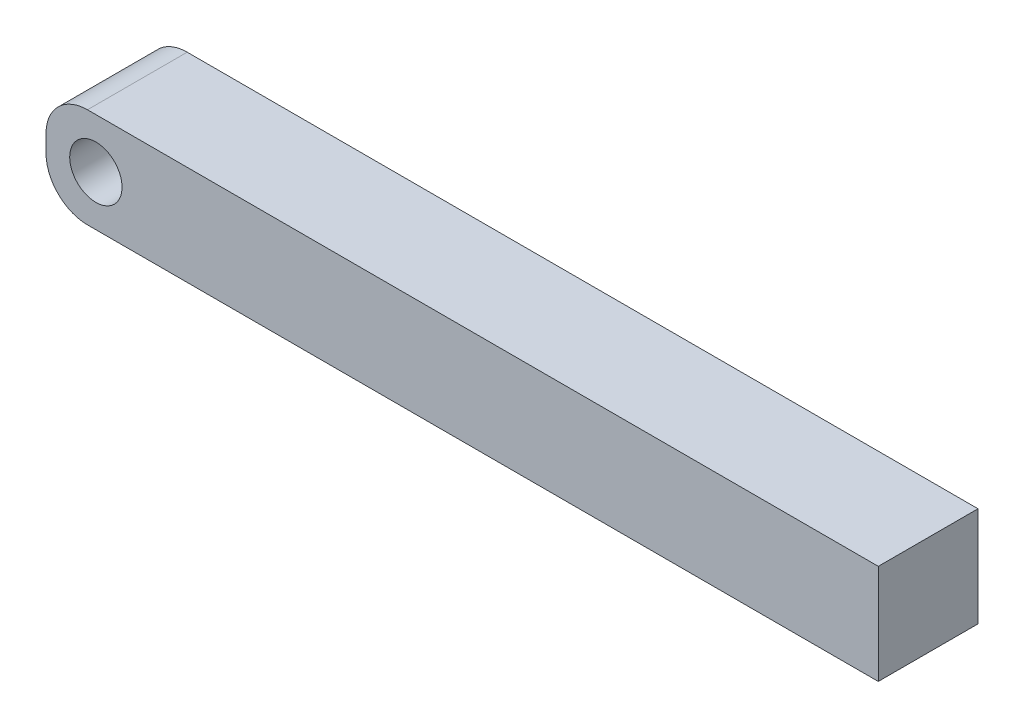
ISO-10303-21;
HEADER;
FILE_DESCRIPTION(('STEP AP214'),'2;1');
FILE_NAME('part.step','',(''),(''),'','','');
FILE_SCHEMA(('AUTOMOTIVE_DESIGN { 1 0 10303 214 1 1 1 1 }'));
ENDSEC;
DATA;
#1=APPLICATION_CONTEXT('core data for automotive mechanical design processes');
#2=APPLICATION_PROTOCOL_DEFINITION('international standard','automotive_design',2000,#1);
#3=PRODUCT_CONTEXT('',#1,'mechanical');
#4=PRODUCT('Part','Part','',(#3));
#5=PRODUCT_RELATED_PRODUCT_CATEGORY('part','',(#4));
#6=PRODUCT_DEFINITION_FORMATION('','',#4);
#7=PRODUCT_DEFINITION_CONTEXT('part definition',#1,'design');
#8=PRODUCT_DEFINITION('design','',#6,#7);
#9=PRODUCT_DEFINITION_SHAPE('','',#8);
#10=(LENGTH_UNIT() NAMED_UNIT(*) SI_UNIT(.MILLI.,.METRE.));
#11=(NAMED_UNIT(*) PLANE_ANGLE_UNIT() SI_UNIT($,.RADIAN.));
#12=(NAMED_UNIT(*) SI_UNIT($,.STERADIAN.) SOLID_ANGLE_UNIT());
#13=UNCERTAINTY_MEASURE_WITH_UNIT(LENGTH_MEASURE(1.E-05),#10,'distance_accuracy_value','');
#14=(GEOMETRIC_REPRESENTATION_CONTEXT(3) GLOBAL_UNCERTAINTY_ASSIGNED_CONTEXT((#13)) GLOBAL_UNIT_ASSIGNED_CONTEXT((#10,
#11,#12)) REPRESENTATION_CONTEXT('',''));
#15=CARTESIAN_POINT('',(0.,0.,0.));
#16=DIRECTION('',(0.,0.,1.));
#17=DIRECTION('',(1.,0.,0.));
#18=AXIS2_PLACEMENT_3D('',#15,#16,#17);
#19=CARTESIAN_POINT('',(0.,0.,9.525));
#20=DIRECTION('',(0.,0.,1.));
#21=DIRECTION('',(1.,0.,0.));
#22=AXIS2_PLACEMENT_3D('',#19,#20,#21);
#23=PLANE('',#22);
#24=DIRECTION('',(0.,-1.,0.));
#25=VECTOR('',#24,1.);
#26=CARTESIAN_POINT('',(-9.525,9.525,9.525));
#27=LINE('',#26,#25);
#28=CARTESIAN_POINT('',(-9.525,1.60020000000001,9.525));
#29=VERTEX_POINT('',#28);
#30=CARTESIAN_POINT('',(-9.525,-1.6002,9.525));
#31=VERTEX_POINT('',#30);
#32=EDGE_CURVE('E109',#29,#31,#27,.T.);
#33=ORIENTED_EDGE('',*,*,#32,.T.);
#34=CARTESIAN_POINT('',(-1.6002,-1.6002,9.525));
#35=DIRECTION('',(0.,0.,1.));
#36=DIRECTION('',(1.,0.,0.));
#37=AXIS2_PLACEMENT_3D('',#34,#35,#36);
#38=CIRCLE('',#37,7.9248);
#39=CARTESIAN_POINT('',(-1.6002,-9.525,9.525));
#40=VERTEX_POINT('',#39);
#41=EDGE_CURVE('E53',#31,#40,#38,.T.);
#42=ORIENTED_EDGE('',*,*,#41,.T.);
#43=DIRECTION('',(1.,0.,0.));
#44=VECTOR('',#43,1.);
#45=CARTESIAN_POINT('',(-9.525,-9.525,9.525));
#46=LINE('',#45,#44);
#47=CARTESIAN_POINT('',(149.479,-9.525,9.525));
#48=VERTEX_POINT('',#47);
#49=EDGE_CURVE('E99',#40,#48,#46,.T.);
#50=ORIENTED_EDGE('',*,*,#49,.T.);
#51=DIRECTION('',(0.,1.,0.));
#52=VECTOR('',#51,1.);
#53=CARTESIAN_POINT('',(149.479,-9.525,9.525));
#54=LINE('',#53,#52);
#55=CARTESIAN_POINT('',(149.479,9.525,9.525));
#56=VERTEX_POINT('',#55);
#57=EDGE_CURVE('E103',#48,#56,#54,.T.);
#58=ORIENTED_EDGE('',*,*,#57,.T.);
#59=DIRECTION('',(-1.,0.,0.));
#60=VECTOR('',#59,1.);
#61=CARTESIAN_POINT('',(149.479,9.525,9.525));
#62=LINE('',#61,#60);
#63=CARTESIAN_POINT('',(-1.6002,9.525,9.525));
#64=VERTEX_POINT('',#63);
#65=EDGE_CURVE('E123',#56,#64,#62,.T.);
#66=ORIENTED_EDGE('',*,*,#65,.T.);
#67=CARTESIAN_POINT('',(-1.6002,1.6002,9.525));
#68=DIRECTION('',(0.,0.,1.));
#69=DIRECTION('',(1.,0.,0.));
#70=AXIS2_PLACEMENT_3D('',#67,#68,#69);
#71=CIRCLE('',#70,7.9248);
#72=EDGE_CURVE('E146',#64,#29,#71,.T.);
#73=ORIENTED_EDGE('',*,*,#72,.T.);
#74=EDGE_LOOP('',(#33,#42,#50,#58,#66,#73));
#75=FACE_BOUND('',#74,.T.);
#76=CARTESIAN_POINT('',(0.,0.,9.525));
#77=DIRECTION('',(0.,0.,1.));
#78=DIRECTION('',(1.,0.,0.));
#79=AXIS2_PLACEMENT_3D('',#76,#77,#78);
#80=CIRCLE('',#79,5.);
#81=CARTESIAN_POINT('',(-5.,0.,9.525));
#82=VERTEX_POINT('',#81);
#83=EDGE_CURVE('E130',#82,#82,#80,.T.);
#84=ORIENTED_EDGE('',*,*,#83,.F.);
#85=EDGE_LOOP('',(#84));
#86=FACE_BOUND('',#85,.T.);
#87=ADVANCED_FACE('F45',(#75,#86),#23,.T.);
#88=CARTESIAN_POINT('',(0.,0.,-9.525));
#89=DIRECTION('',(0.,0.,1.));
#90=DIRECTION('',(1.,0.,0.));
#91=AXIS2_PLACEMENT_3D('',#88,#89,#90);
#92=PLANE('',#91);
#93=DIRECTION('',(1.,0.,0.));
#94=VECTOR('',#93,1.);
#95=CARTESIAN_POINT('',(-9.525,-9.525,-9.525));
#96=LINE('',#95,#94);
#97=CARTESIAN_POINT('',(-1.6002,-9.525,-9.525));
#98=VERTEX_POINT('',#97);
#99=CARTESIAN_POINT('',(149.479,-9.525,-9.525));
#100=VERTEX_POINT('',#99);
#101=EDGE_CURVE('E115',#98,#100,#96,.T.);
#102=ORIENTED_EDGE('',*,*,#101,.F.);
#103=CARTESIAN_POINT('',(-1.6002,-1.6002,-9.525));
#104=DIRECTION('',(0.,0.,1.));
#105=DIRECTION('',(1.,0.,0.));
#106=AXIS2_PLACEMENT_3D('',#103,#104,#105);
#107=CIRCLE('',#106,7.9248);
#108=CARTESIAN_POINT('',(-9.525,-1.6002,-9.525));
#109=VERTEX_POINT('',#108);
#110=EDGE_CURVE('E140',#98,#109,#107,.F.);
#111=ORIENTED_EDGE('',*,*,#110,.T.);
#112=DIRECTION('',(0.,-1.,0.));
#113=VECTOR('',#112,1.);
#114=CARTESIAN_POINT('',(-9.525,9.525,-9.525));
#115=LINE('',#114,#113);
#116=CARTESIAN_POINT('',(-9.525,1.60020000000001,-9.525));
#117=VERTEX_POINT('',#116);
#118=EDGE_CURVE('E128',#117,#109,#115,.T.);
#119=ORIENTED_EDGE('',*,*,#118,.F.);
#120=CARTESIAN_POINT('',(-1.6002,1.6002,-9.525));
#121=DIRECTION('',(0.,0.,1.));
#122=DIRECTION('',(1.,0.,0.));
#123=AXIS2_PLACEMENT_3D('',#120,#121,#122);
#124=CIRCLE('',#123,7.9248);
#125=CARTESIAN_POINT('',(-1.6002,9.525,-9.525));
#126=VERTEX_POINT('',#125);
#127=EDGE_CURVE('E138',#117,#126,#124,.F.);
#128=ORIENTED_EDGE('',*,*,#127,.T.);
#129=DIRECTION('',(-1.,0.,0.));
#130=VECTOR('',#129,1.);
#131=CARTESIAN_POINT('',(149.479,9.525,-9.525));
#132=LINE('',#131,#130);
#133=CARTESIAN_POINT('',(149.479,9.525,-9.525));
#134=VERTEX_POINT('',#133);
#135=EDGE_CURVE('E134',#134,#126,#132,.T.);
#136=ORIENTED_EDGE('',*,*,#135,.F.);
#137=DIRECTION('',(0.,1.,0.));
#138=VECTOR('',#137,1.);
#139=CARTESIAN_POINT('',(149.479,-9.525,-9.525));
#140=LINE('',#139,#138);
#141=EDGE_CURVE('E132',#100,#134,#140,.T.);
#142=ORIENTED_EDGE('',*,*,#141,.F.);
#143=EDGE_LOOP('',(#102,#111,#119,#128,#136,#142));
#144=FACE_BOUND('',#143,.T.);
#145=CARTESIAN_POINT('',(0.,0.,-9.525));
#146=DIRECTION('',(0.,0.,1.));
#147=DIRECTION('',(1.,0.,0.));
#148=AXIS2_PLACEMENT_3D('',#145,#146,#147);
#149=CIRCLE('',#148,5.);
#150=CARTESIAN_POINT('',(-5.,0.,-9.525));
#151=VERTEX_POINT('',#150);
#152=EDGE_CURVE('E236',#151,#151,#149,.T.);
#153=ORIENTED_EDGE('',*,*,#152,.T.);
#154=EDGE_LOOP('',(#153));
#155=FACE_BOUND('',#154,.T.);
#156=ADVANCED_FACE('F154',(#144,#155),#92,.F.);
#157=CARTESIAN_POINT('',(-9.525,9.525,9.525));
#158=DIRECTION('',(1.,0.,0.));
#159=DIRECTION('',(0.,0.,-1.));
#160=AXIS2_PLACEMENT_3D('',#157,#158,#159);
#161=PLANE('',#160);
#162=ORIENTED_EDGE('',*,*,#118,.T.);
#163=DIRECTION('',(0.,0.,-1.));
#164=VECTOR('',#163,1.);
#165=CARTESIAN_POINT('',(-9.525,-1.6002,9.525));
#166=LINE('',#165,#164);
#167=EDGE_CURVE('E66',#109,#31,#166,.F.);
#168=ORIENTED_EDGE('',*,*,#167,.T.);
#169=ORIENTED_EDGE('',*,*,#32,.F.);
#170=DIRECTION('',(0.,0.,-1.));
#171=VECTOR('',#170,1.);
#172=CARTESIAN_POINT('',(-9.525,1.6002,9.525));
#173=LINE('',#172,#171);
#174=EDGE_CURVE('E142',#29,#117,#173,.T.);
#175=ORIENTED_EDGE('',*,*,#174,.T.);
#176=EDGE_LOOP('',(#162,#168,#169,#175));
#177=FACE_BOUND('',#176,.T.);
#178=ADVANCED_FACE('F150',(#177),#161,.F.);
#179=CARTESIAN_POINT('',(-9.525,-9.525,9.525));
#180=DIRECTION('',(0.,1.,0.));
#181=DIRECTION('',(0.,0.,1.));
#182=AXIS2_PLACEMENT_3D('',#179,#180,#181);
#183=PLANE('',#182);
#184=ORIENTED_EDGE('',*,*,#49,.F.);
#185=DIRECTION('',(0.,0.,-1.));
#186=VECTOR('',#185,1.);
#187=CARTESIAN_POINT('',(-1.6002,-9.525,9.525));
#188=LINE('',#187,#186);
#189=EDGE_CURVE('E118',#40,#98,#188,.T.);
#190=ORIENTED_EDGE('',*,*,#189,.T.);
#191=ORIENTED_EDGE('',*,*,#101,.T.);
#192=DIRECTION('',(0.,0.,-1.));
#193=VECTOR('',#192,1.);
#194=CARTESIAN_POINT('',(149.479,-9.525,9.525));
#195=LINE('',#194,#193);
#196=EDGE_CURVE('E112',#48,#100,#195,.T.);
#197=ORIENTED_EDGE('',*,*,#196,.F.);
#198=EDGE_LOOP('',(#184,#190,#191,#197));
#199=FACE_BOUND('',#198,.T.);
#200=ADVANCED_FACE('F113',(#199),#183,.F.);
#201=CARTESIAN_POINT('',(149.479,-9.525,9.525));
#202=DIRECTION('',(-1.,0.,0.));
#203=DIRECTION('',(0.,0.,1.));
#204=AXIS2_PLACEMENT_3D('',#201,#202,#203);
#205=PLANE('',#204);
#206=ORIENTED_EDGE('',*,*,#141,.T.);
#207=DIRECTION('',(0.,0.,-1.));
#208=VECTOR('',#207,1.);
#209=CARTESIAN_POINT('',(149.479,9.525,9.525));
#210=LINE('',#209,#208);
#211=EDGE_CURVE('E119',#56,#134,#210,.T.);
#212=ORIENTED_EDGE('',*,*,#211,.F.);
#213=ORIENTED_EDGE('',*,*,#57,.F.);
#214=ORIENTED_EDGE('',*,*,#196,.T.);
#215=EDGE_LOOP('',(#206,#212,#213,#214));
#216=FACE_BOUND('',#215,.T.);
#217=ADVANCED_FACE('F121',(#216),#205,.F.);
#218=CARTESIAN_POINT('',(149.479,9.525,9.525));
#219=DIRECTION('',(0.,-1.,0.));
#220=DIRECTION('',(0.,0.,-1.));
#221=AXIS2_PLACEMENT_3D('',#218,#219,#220);
#222=PLANE('',#221);
#223=ORIENTED_EDGE('',*,*,#135,.T.);
#224=DIRECTION('',(0.,0.,-1.));
#225=VECTOR('',#224,1.);
#226=CARTESIAN_POINT('',(-1.6002,9.525,9.525));
#227=LINE('',#226,#225);
#228=EDGE_CURVE('E13',#126,#64,#227,.F.);
#229=ORIENTED_EDGE('',*,*,#228,.T.);
#230=ORIENTED_EDGE('',*,*,#65,.F.);
#231=ORIENTED_EDGE('',*,*,#211,.T.);
#232=EDGE_LOOP('',(#223,#229,#230,#231));
#233=FACE_BOUND('',#232,.T.);
#234=ADVANCED_FACE('F156',(#233),#222,.F.);
#235=CARTESIAN_POINT('',(0.,0.,9.525));
#236=DIRECTION('',(0.,0.,-1.));
#237=DIRECTION('',(-1.,0.,0.));
#238=AXIS2_PLACEMENT_3D('',#235,#236,#237);
#239=CYLINDRICAL_SURFACE('',#238,5.);
#240=CARTESIAN_POINT('',(-5.,0.,9.525));
#241=CARTESIAN_POINT('',(-5.,0.,9.3265625));
#242=CARTESIAN_POINT('',(-5.,0.,9.128125));
#243=CARTESIAN_POINT('',(-5.,0.,8.73125));
#244=CARTESIAN_POINT('',(-5.,0.,8.5328125));
#245=CARTESIAN_POINT('',(-5.,0.,8.1359375));
#246=CARTESIAN_POINT('',(-5.,0.,7.9375));
#247=CARTESIAN_POINT('',(-5.,0.,7.540625));
#248=CARTESIAN_POINT('',(-5.,0.,7.3421875));
#249=CARTESIAN_POINT('',(-5.,0.,6.9453125));
#250=CARTESIAN_POINT('',(-5.,0.,6.746875));
#251=CARTESIAN_POINT('',(-5.,0.,6.35));
#252=CARTESIAN_POINT('',(-5.,0.,6.1515625));
#253=CARTESIAN_POINT('',(-5.,0.,5.7546875));
#254=CARTESIAN_POINT('',(-5.,0.,5.55625));
#255=CARTESIAN_POINT('',(-5.,0.,5.159375));
#256=CARTESIAN_POINT('',(-5.,0.,4.9609375));
#257=CARTESIAN_POINT('',(-5.,0.,4.5640625));
#258=CARTESIAN_POINT('',(-5.,0.,4.365625));
#259=CARTESIAN_POINT('',(-5.,0.,3.96875));
#260=CARTESIAN_POINT('',(-5.,0.,3.7703125));
#261=CARTESIAN_POINT('',(-5.,0.,3.3734375));
#262=CARTESIAN_POINT('',(-5.,0.,3.175));
#263=CARTESIAN_POINT('',(-5.,0.,2.778125));
#264=CARTESIAN_POINT('',(-5.,0.,2.5796875));
#265=CARTESIAN_POINT('',(-5.,0.,2.1828125));
#266=CARTESIAN_POINT('',(-5.,0.,1.984375));
#267=CARTESIAN_POINT('',(-5.,0.,1.5875));
#268=CARTESIAN_POINT('',(-5.,0.,1.3890625));
#269=CARTESIAN_POINT('',(-5.,0.,0.992187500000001));
#270=CARTESIAN_POINT('',(-5.,0.,0.793750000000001));
#271=CARTESIAN_POINT('',(-5.,0.,0.396875));
#272=CARTESIAN_POINT('',(-5.,0.,0.1984375));
#273=CARTESIAN_POINT('',(-5.,0.,-0.1984375));
#274=CARTESIAN_POINT('',(-5.,0.,-0.396875));
#275=CARTESIAN_POINT('',(-5.,0.,-0.793750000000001));
#276=CARTESIAN_POINT('',(-5.,0.,-0.992187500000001));
#277=CARTESIAN_POINT('',(-5.,0.,-1.3890625));
#278=CARTESIAN_POINT('',(-5.,0.,-1.5875));
#279=CARTESIAN_POINT('',(-5.,0.,-1.984375));
#280=CARTESIAN_POINT('',(-5.,0.,-2.1828125));
#281=CARTESIAN_POINT('',(-5.,0.,-2.5796875));
#282=CARTESIAN_POINT('',(-5.,0.,-2.778125));
#283=CARTESIAN_POINT('',(-5.,0.,-3.175));
#284=CARTESIAN_POINT('',(-5.,0.,-3.3734375));
#285=CARTESIAN_POINT('',(-5.,0.,-3.7703125));
#286=CARTESIAN_POINT('',(-5.,0.,-3.96875));
#287=CARTESIAN_POINT('',(-5.,0.,-4.365625));
#288=CARTESIAN_POINT('',(-5.,0.,-4.5640625));
#289=CARTESIAN_POINT('',(-5.,0.,-4.9609375));
#290=CARTESIAN_POINT('',(-5.,0.,-5.159375));
#291=CARTESIAN_POINT('',(-5.,0.,-5.55625));
#292=CARTESIAN_POINT('',(-5.,0.,-5.7546875));
#293=CARTESIAN_POINT('',(-5.,0.,-6.1515625));
#294=CARTESIAN_POINT('',(-5.,0.,-6.35));
#295=CARTESIAN_POINT('',(-5.,0.,-6.746875));
#296=CARTESIAN_POINT('',(-5.,0.,-6.9453125));
#297=CARTESIAN_POINT('',(-5.,0.,-7.3421875));
#298=CARTESIAN_POINT('',(-5.,0.,-7.540625));
#299=CARTESIAN_POINT('',(-5.,0.,-7.9375));
#300=CARTESIAN_POINT('',(-5.,0.,-8.1359375));
#301=CARTESIAN_POINT('',(-5.,0.,-8.5328125));
#302=CARTESIAN_POINT('',(-5.,0.,-8.73125));
#303=CARTESIAN_POINT('',(-5.,0.,-9.128125));
#304=CARTESIAN_POINT('',(-5.,0.,-9.3265625));
#305=CARTESIAN_POINT('',(-5.,0.,-9.525));
#306=B_SPLINE_CURVE_WITH_KNOTS('',3,(#240,#241,#242,#243,#244,#245,#246,#247,#248,#249,#250,
#251,#252,#253,#254,#255,#256,#257,#258,#259,#260,#261,#262,#263,#264,#265,#266,#267,#268,#269,
#270,#271,#272,#273,#274,#275,#276,#277,#278,#279,#280,#281,#282,#283,#284,#285,#286,#287,#288,
#289,#290,#291,#292,#293,#294,#295,#296,#297,#298,#299,#300,#301,#302,#303,#304,#305),
.UNSPECIFIED.,.F.,.F.,(4,2,2,2,2,2,2,2,2,2,2,2,2,2,2,2,2,2,2,2,2,2,2,2,2,2,2,2,2,2,2,2,4),(0.,
0.5953125,1.190625,1.7859375,2.38125,2.9765625,3.571875,4.1671875,4.7625,5.3578125,5.953125,
6.5484375,7.14375,7.7390625,8.334375,8.9296875,9.525,10.1203125,10.715625,11.3109375,11.90625,
12.5015625,13.096875,13.6921875,14.2875,14.8828125,15.478125,16.0734375,16.66875,17.2640625,
17.859375,18.4546875,19.05),.UNSPECIFIED.);
#307=EDGE_CURVE('BSEAM158',#82,#151,#306,.T.);
#308=ORIENTED_EDGE('',*,*,#83,.T.);
#309=ORIENTED_EDGE('',*,*,#152,.F.);
#310=ORIENTED_EDGE('',*,*,#307,.T.);
#311=ORIENTED_EDGE('',*,*,#307,.F.);
#312=EDGE_LOOP('',(#308,#310,#309,#311));
#313=FACE_BOUND('',#312,.T.);
#314=ADVANCED_FACE('F158',(#313),#239,.F.);
#315=CARTESIAN_POINT('',(-1.6002,-1.6002,9.525));
#316=DIRECTION('',(0.,0.,-1.));
#317=DIRECTION('',(-1.,0.,0.));
#318=AXIS2_PLACEMENT_3D('',#315,#316,#317);
#319=CYLINDRICAL_SURFACE('',#318,7.9248);
#320=ORIENTED_EDGE('',*,*,#41,.F.);
#321=ORIENTED_EDGE('',*,*,#167,.F.);
#322=ORIENTED_EDGE('',*,*,#110,.F.);
#323=ORIENTED_EDGE('',*,*,#189,.F.);
#324=EDGE_LOOP('',(#320,#321,#322,#323));
#325=FACE_BOUND('',#324,.T.);
#326=ADVANCED_FACE('F164',(#325),#319,.T.);
#327=CARTESIAN_POINT('',(-1.6002,1.6002,9.525));
#328=DIRECTION('',(0.,0.,-1.));
#329=DIRECTION('',(-1.,0.,0.));
#330=AXIS2_PLACEMENT_3D('',#327,#328,#329);
#331=CYLINDRICAL_SURFACE('',#330,7.9248);
#332=ORIENTED_EDGE('',*,*,#72,.F.);
#333=ORIENTED_EDGE('',*,*,#228,.F.);
#334=ORIENTED_EDGE('',*,*,#127,.F.);
#335=ORIENTED_EDGE('',*,*,#174,.F.);
#336=EDGE_LOOP('',(#332,#333,#334,#335));
#337=FACE_BOUND('',#336,.T.);
#338=ADVANCED_FACE('F47',(#337),#331,.T.);
#339=CLOSED_SHELL('',(#87,#156,#178,#200,#217,#234,#314,#326,#338));
#340=MANIFOLD_SOLID_BREP('B2',#339);
#341=ADVANCED_BREP_SHAPE_REPRESENTATION('',(#18,#340),#14);
#342=SHAPE_DEFINITION_REPRESENTATION(#9,#341);
ENDSEC;
END-ISO-10303-21;
